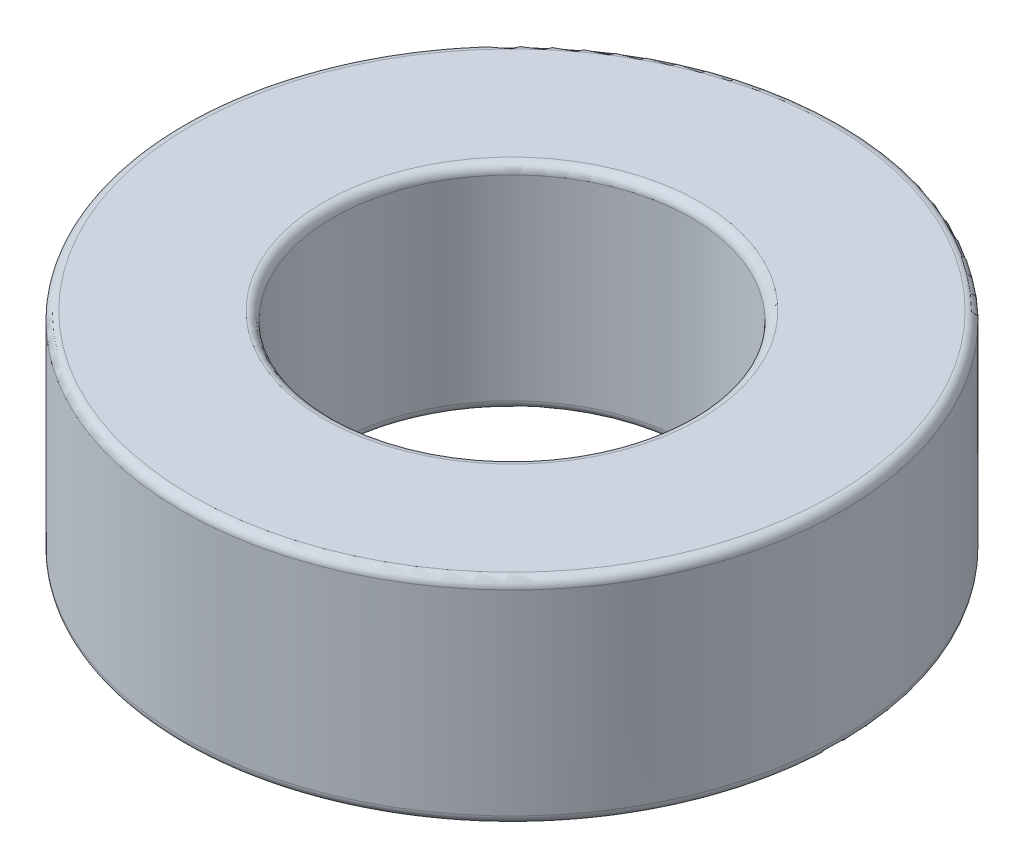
from build123d import *

# Parameters (mm, degrees)
FILLET1_R = 0.254


with BuildPart() as part:
    # Sketch1 → Revolve1 (revolve)
    with BuildSketch(Plane(origin=(0, 0, 0), x_dir=(0, 0, -1), z_dir=(1, 0, 0))):
        with BuildLine():
            Line((5.025, 0), (5.025, 6))
            Line((5.025, 6), (9.25, 6))
            Line((9.25, 6), (9.25, 0))
            Line((9.25, 0), (8.3439, 0))
            Line((8.3439, 0), (8.3439, 1.016))
            ThreePointArc((8.3439, 1.016), (8.269505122, 1.195605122), (8.0899, 1.27))
            Line((8.0899, 1.27), (6.4643, 1.27))
            ThreePointArc((6.4643, 1.27), (6.284694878, 1.195605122), (6.2103, 1.016))
            Line((6.2103, 1.016), (6.2103, 0))
            Line((6.2103, 0), (5.025, 0))
        make_face()
    revolve(axis=Axis((0, 0, 0), (0, 1, 0)))

    # Fillet1
    fillet1_edges = [part.edges().sort_by_distance(p)[0] for p in [
        (0, 0, 5.025),
        (0, 6, 5.025),
        (0, 6, 9.25),
        (0, 0, 9.25),
    ]]
    fillet(fillet1_edges, radius=FILLET1_R)


solid = part.part
